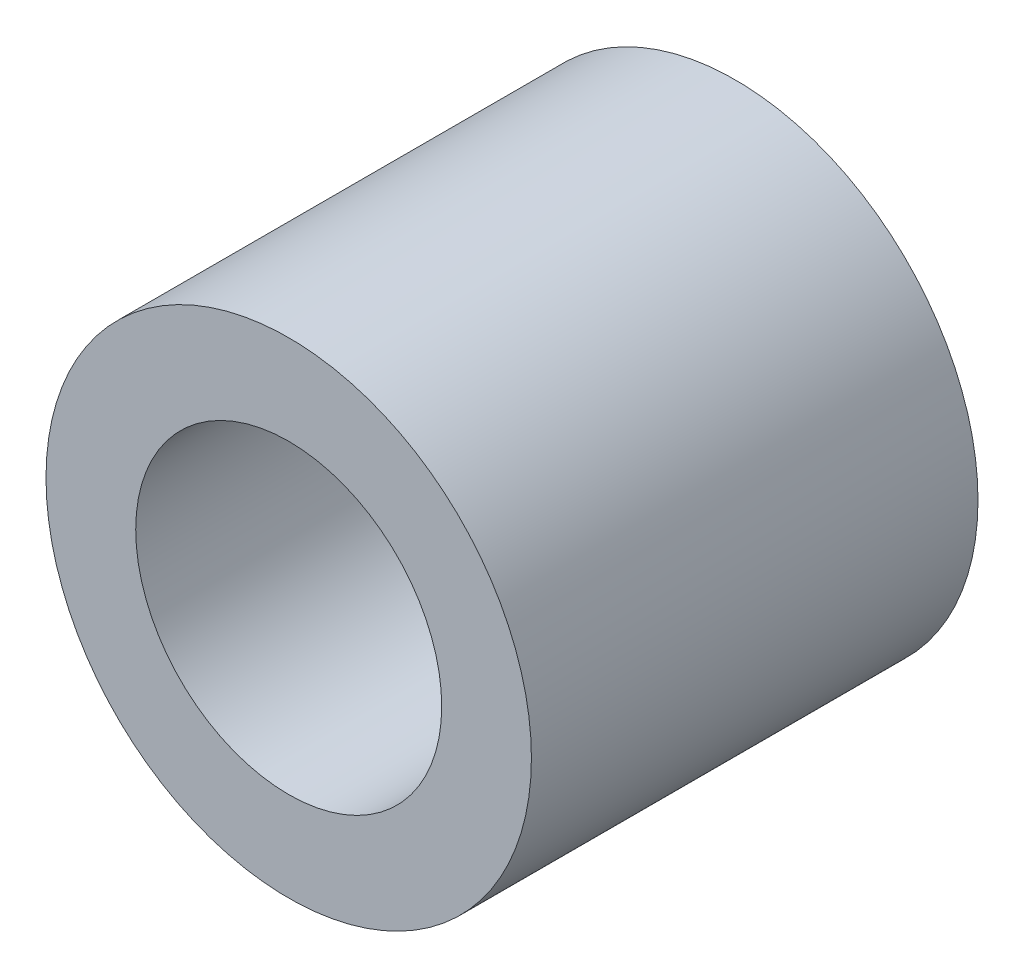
ISO-10303-21;
HEADER;
FILE_DESCRIPTION(('STEP AP214'),'2;1');
FILE_NAME('part.step','',(''),(''),'','','');
FILE_SCHEMA(('AUTOMOTIVE_DESIGN { 1 0 10303 214 1 1 1 1 }'));
ENDSEC;
DATA;
#1=APPLICATION_CONTEXT('core data for automotive mechanical design processes');
#2=APPLICATION_PROTOCOL_DEFINITION('international standard','automotive_design',2000,#1);
#3=PRODUCT_CONTEXT('',#1,'mechanical');
#4=PRODUCT('Part','Part','',(#3));
#5=PRODUCT_RELATED_PRODUCT_CATEGORY('part','',(#4));
#6=PRODUCT_DEFINITION_FORMATION('','',#4);
#7=PRODUCT_DEFINITION_CONTEXT('part definition',#1,'design');
#8=PRODUCT_DEFINITION('design','',#6,#7);
#9=PRODUCT_DEFINITION_SHAPE('','',#8);
#10=(LENGTH_UNIT() NAMED_UNIT(*) SI_UNIT(.MILLI.,.METRE.));
#11=(NAMED_UNIT(*) PLANE_ANGLE_UNIT() SI_UNIT($,.RADIAN.));
#12=(NAMED_UNIT(*) SI_UNIT($,.STERADIAN.) SOLID_ANGLE_UNIT());
#13=UNCERTAINTY_MEASURE_WITH_UNIT(LENGTH_MEASURE(1.E-05),#10,'distance_accuracy_value','');
#14=(GEOMETRIC_REPRESENTATION_CONTEXT(3) GLOBAL_UNCERTAINTY_ASSIGNED_CONTEXT((#13)) GLOBAL_UNIT_ASSIGNED_CONTEXT((#10,
#11,#12)) REPRESENTATION_CONTEXT('',''));
#15=CARTESIAN_POINT('',(0.,0.,0.));
#16=DIRECTION('',(0.,0.,1.));
#17=DIRECTION('',(1.,0.,0.));
#18=AXIS2_PLACEMENT_3D('',#15,#16,#17);
#19=CARTESIAN_POINT('',(0.,0.,14.605));
#20=DIRECTION('',(0.,0.,1.));
#21=DIRECTION('',(1.,0.,0.));
#22=AXIS2_PLACEMENT_3D('',#19,#20,#21);
#23=PLANE('',#22);
#24=CARTESIAN_POINT('',(0.,0.,14.605));
#25=DIRECTION('',(0.,0.,1.));
#26=DIRECTION('',(1.,0.,0.));
#27=AXIS2_PLACEMENT_3D('',#24,#25,#26);
#28=CIRCLE('',#27,7.9375);
#29=CARTESIAN_POINT('',(-7.9375,0.,14.605));
#30=VERTEX_POINT('',#29);
#31=EDGE_CURVE('E10',#30,#30,#28,.T.);
#32=ORIENTED_EDGE('',*,*,#31,.T.);
#33=EDGE_LOOP('',(#32));
#34=FACE_BOUND('',#33,.T.);
#35=CARTESIAN_POINT('',(0.,0.,14.605));
#36=DIRECTION('',(0.,0.,1.));
#37=DIRECTION('',(1.,0.,0.));
#38=AXIS2_PLACEMENT_3D('',#35,#36,#37);
#39=CIRCLE('',#38,5.0038);
#40=CARTESIAN_POINT('',(-5.0038,0.,14.605));
#41=VERTEX_POINT('',#40);
#42=EDGE_CURVE('E42',#41,#41,#39,.T.);
#43=ORIENTED_EDGE('',*,*,#42,.F.);
#44=EDGE_LOOP('',(#43));
#45=FACE_BOUND('',#44,.T.);
#46=ADVANCED_FACE('F31',(#34,#45),#23,.T.);
#47=CARTESIAN_POINT('',(0.,0.,0.));
#48=DIRECTION('',(0.,0.,1.));
#49=DIRECTION('',(1.,0.,0.));
#50=AXIS2_PLACEMENT_3D('',#47,#48,#49);
#51=PLANE('',#50);
#52=CARTESIAN_POINT('',(0.,0.,0.));
#53=DIRECTION('',(0.,0.,1.));
#54=DIRECTION('',(1.,0.,0.));
#55=AXIS2_PLACEMENT_3D('',#52,#53,#54);
#56=CIRCLE('',#55,7.9375);
#57=CARTESIAN_POINT('',(-7.9375,0.,0.));
#58=VERTEX_POINT('',#57);
#59=EDGE_CURVE('E35',#58,#58,#56,.T.);
#60=ORIENTED_EDGE('',*,*,#59,.F.);
#61=EDGE_LOOP('',(#60));
#62=FACE_BOUND('',#61,.T.);
#63=CARTESIAN_POINT('',(0.,0.,0.));
#64=DIRECTION('',(0.,0.,1.));
#65=DIRECTION('',(1.,0.,0.));
#66=AXIS2_PLACEMENT_3D('',#63,#64,#65);
#67=CIRCLE('',#66,5.0038);
#68=CARTESIAN_POINT('',(-5.0038,0.,0.));
#69=VERTEX_POINT('',#68);
#70=EDGE_CURVE('E44',#69,#69,#67,.T.);
#71=ORIENTED_EDGE('',*,*,#70,.T.);
#72=EDGE_LOOP('',(#71));
#73=FACE_BOUND('',#72,.T.);
#74=ADVANCED_FACE('F54',(#62,#73),#51,.F.);
#75=CARTESIAN_POINT('',(0.,0.,14.605));
#76=DIRECTION('',(0.,0.,-1.));
#77=DIRECTION('',(-1.,0.,0.));
#78=AXIS2_PLACEMENT_3D('',#75,#76,#77);
#79=CYLINDRICAL_SURFACE('',#78,7.9375);
#80=CARTESIAN_POINT('',(-7.9375,0.,14.605));
#81=CARTESIAN_POINT('',(-7.9375,0.,14.4528645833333));
#82=CARTESIAN_POINT('',(-7.9375,0.,14.3007291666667));
#83=CARTESIAN_POINT('',(-7.9375,0.,13.9964583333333));
#84=CARTESIAN_POINT('',(-7.9375,0.,13.8443229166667));
#85=CARTESIAN_POINT('',(-7.9375,0.,13.5400520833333));
#86=CARTESIAN_POINT('',(-7.9375,0.,13.3879166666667));
#87=CARTESIAN_POINT('',(-7.9375,0.,13.0836458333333));
#88=CARTESIAN_POINT('',(-7.9375,0.,12.9315104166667));
#89=CARTESIAN_POINT('',(-7.9375,0.,12.6272395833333));
#90=CARTESIAN_POINT('',(-7.9375,0.,12.4751041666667));
#91=CARTESIAN_POINT('',(-7.9375,0.,12.1708333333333));
#92=CARTESIAN_POINT('',(-7.9375,0.,12.0186979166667));
#93=CARTESIAN_POINT('',(-7.9375,0.,11.7144270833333));
#94=CARTESIAN_POINT('',(-7.9375,0.,11.5622916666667));
#95=CARTESIAN_POINT('',(-7.9375,0.,11.2580208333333));
#96=CARTESIAN_POINT('',(-7.9375,0.,11.1058854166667));
#97=CARTESIAN_POINT('',(-7.9375,0.,10.8016145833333));
#98=CARTESIAN_POINT('',(-7.9375,0.,10.6494791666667));
#99=CARTESIAN_POINT('',(-7.9375,0.,10.3452083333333));
#100=CARTESIAN_POINT('',(-7.9375,0.,10.1930729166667));
#101=CARTESIAN_POINT('',(-7.9375,0.,9.88880208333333));
#102=CARTESIAN_POINT('',(-7.9375,0.,9.73666666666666));
#103=CARTESIAN_POINT('',(-7.9375,0.,9.43239583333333));
#104=CARTESIAN_POINT('',(-7.9375,0.,9.28026041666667));
#105=CARTESIAN_POINT('',(-7.9375,0.,8.97598958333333));
#106=CARTESIAN_POINT('',(-7.9375,0.,8.82385416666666));
#107=CARTESIAN_POINT('',(-7.9375,0.,8.51958333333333));
#108=CARTESIAN_POINT('',(-7.9375,0.,8.36744791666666));
#109=CARTESIAN_POINT('',(-7.9375,0.,8.06317708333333));
#110=CARTESIAN_POINT('',(-7.9375,0.,7.91104166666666));
#111=CARTESIAN_POINT('',(-7.9375,0.,7.60677083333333));
#112=CARTESIAN_POINT('',(-7.9375,0.,7.45463541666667));
#113=CARTESIAN_POINT('',(-7.9375,0.,7.15036458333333));
#114=CARTESIAN_POINT('',(-7.9375,0.,6.99822916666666));
#115=CARTESIAN_POINT('',(-7.9375,0.,6.69395833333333));
#116=CARTESIAN_POINT('',(-7.9375,0.,6.54182291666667));
#117=CARTESIAN_POINT('',(-7.9375,0.,6.23755208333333));
#118=CARTESIAN_POINT('',(-7.9375,0.,6.08541666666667));
#119=CARTESIAN_POINT('',(-7.9375,0.,5.78114583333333));
#120=CARTESIAN_POINT('',(-7.9375,0.,5.62901041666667));
#121=CARTESIAN_POINT('',(-7.9375,0.,5.32473958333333));
#122=CARTESIAN_POINT('',(-7.9375,0.,5.17260416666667));
#123=CARTESIAN_POINT('',(-7.9375,0.,4.86833333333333));
#124=CARTESIAN_POINT('',(-7.9375,0.,4.71619791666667));
#125=CARTESIAN_POINT('',(-7.9375,0.,4.41192708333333));
#126=CARTESIAN_POINT('',(-7.9375,0.,4.25979166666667));
#127=CARTESIAN_POINT('',(-7.9375,0.,3.95552083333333));
#128=CARTESIAN_POINT('',(-7.9375,0.,3.80338541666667));
#129=CARTESIAN_POINT('',(-7.9375,0.,3.49911458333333));
#130=CARTESIAN_POINT('',(-7.9375,0.,3.34697916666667));
#131=CARTESIAN_POINT('',(-7.9375,0.,3.04270833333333));
#132=CARTESIAN_POINT('',(-7.9375,0.,2.89057291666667));
#133=CARTESIAN_POINT('',(-7.9375,0.,2.58630208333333));
#134=CARTESIAN_POINT('',(-7.9375,0.,2.43416666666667));
#135=CARTESIAN_POINT('',(-7.9375,0.,2.12989583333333));
#136=CARTESIAN_POINT('',(-7.9375,0.,1.97776041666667));
#137=CARTESIAN_POINT('',(-7.9375,0.,1.67348958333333));
#138=CARTESIAN_POINT('',(-7.9375,0.,1.52135416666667));
#139=CARTESIAN_POINT('',(-7.9375,0.,1.21708333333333));
#140=CARTESIAN_POINT('',(-7.9375,0.,1.06494791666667));
#141=CARTESIAN_POINT('',(-7.9375,0.,0.760677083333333));
#142=CARTESIAN_POINT('',(-7.9375,0.,0.608541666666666));
#143=CARTESIAN_POINT('',(-7.9375,0.,0.304270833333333));
#144=CARTESIAN_POINT('',(-7.9375,0.,0.152135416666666));
#145=CARTESIAN_POINT('',(-7.9375,0.,0.));
#146=B_SPLINE_CURVE_WITH_KNOTS('',3,(#80,#81,#82,#83,#84,#85,#86,#87,#88,#89,#90,#91,#92,#93,
#94,#95,#96,#97,#98,#99,#100,#101,#102,#103,#104,#105,#106,#107,#108,#109,#110,#111,#112,#113,
#114,#115,#116,#117,#118,#119,#120,#121,#122,#123,#124,#125,#126,#127,#128,#129,#130,#131,#132,
#133,#134,#135,#136,#137,#138,#139,#140,#141,#142,#143,#144,#145),.UNSPECIFIED.,.F.,.F.,(4,2,2,
2,2,2,2,2,2,2,2,2,2,2,2,2,2,2,2,2,2,2,2,2,2,2,2,2,2,2,2,2,4),(0.,0.456406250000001,0.9128125,
1.36921875,1.825625,2.28203125,2.7384375,3.19484375,3.65125,4.10765625,4.5640625,5.02046875,
5.476875,5.93328125,6.3896875,6.84609375,7.3025,7.75890625,8.2153125,8.67171875,9.128125,
9.58453125,10.0409375,10.49734375,10.95375,11.41015625,11.8665625,12.32296875,12.779375,
13.23578125,13.6921875,14.14859375,14.605),.UNSPECIFIED.);
#147=EDGE_CURVE('BSEAM33',#30,#58,#146,.T.);
#148=ORIENTED_EDGE('',*,*,#31,.F.);
#149=ORIENTED_EDGE('',*,*,#59,.T.);
#150=ORIENTED_EDGE('',*,*,#147,.T.);
#151=ORIENTED_EDGE('',*,*,#147,.F.);
#152=EDGE_LOOP('',(#148,#150,#149,#151));
#153=FACE_BOUND('',#152,.T.);
#154=ADVANCED_FACE('F33',(#153),#79,.T.);
#155=CARTESIAN_POINT('',(0.,0.,14.605));
#156=DIRECTION('',(0.,0.,-1.));
#157=DIRECTION('',(-1.,0.,0.));
#158=AXIS2_PLACEMENT_3D('',#155,#156,#157);
#159=CYLINDRICAL_SURFACE('',#158,5.0038);
#160=CARTESIAN_POINT('',(-5.0038,0.,14.605));
#161=CARTESIAN_POINT('',(-5.0038,0.,14.4528645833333));
#162=CARTESIAN_POINT('',(-5.0038,0.,14.3007291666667));
#163=CARTESIAN_POINT('',(-5.0038,0.,13.9964583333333));
#164=CARTESIAN_POINT('',(-5.0038,0.,13.8443229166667));
#165=CARTESIAN_POINT('',(-5.0038,0.,13.5400520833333));
#166=CARTESIAN_POINT('',(-5.0038,0.,13.3879166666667));
#167=CARTESIAN_POINT('',(-5.0038,0.,13.0836458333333));
#168=CARTESIAN_POINT('',(-5.0038,0.,12.9315104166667));
#169=CARTESIAN_POINT('',(-5.0038,0.,12.6272395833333));
#170=CARTESIAN_POINT('',(-5.0038,0.,12.4751041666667));
#171=CARTESIAN_POINT('',(-5.0038,0.,12.1708333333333));
#172=CARTESIAN_POINT('',(-5.0038,0.,12.0186979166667));
#173=CARTESIAN_POINT('',(-5.0038,0.,11.7144270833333));
#174=CARTESIAN_POINT('',(-5.0038,0.,11.5622916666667));
#175=CARTESIAN_POINT('',(-5.0038,0.,11.2580208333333));
#176=CARTESIAN_POINT('',(-5.0038,0.,11.1058854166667));
#177=CARTESIAN_POINT('',(-5.0038,0.,10.8016145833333));
#178=CARTESIAN_POINT('',(-5.0038,0.,10.6494791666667));
#179=CARTESIAN_POINT('',(-5.0038,0.,10.3452083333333));
#180=CARTESIAN_POINT('',(-5.0038,0.,10.1930729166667));
#181=CARTESIAN_POINT('',(-5.0038,0.,9.88880208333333));
#182=CARTESIAN_POINT('',(-5.0038,0.,9.73666666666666));
#183=CARTESIAN_POINT('',(-5.0038,0.,9.43239583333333));
#184=CARTESIAN_POINT('',(-5.0038,0.,9.28026041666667));
#185=CARTESIAN_POINT('',(-5.0038,0.,8.97598958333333));
#186=CARTESIAN_POINT('',(-5.0038,0.,8.82385416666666));
#187=CARTESIAN_POINT('',(-5.0038,0.,8.51958333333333));
#188=CARTESIAN_POINT('',(-5.0038,0.,8.36744791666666));
#189=CARTESIAN_POINT('',(-5.0038,0.,8.06317708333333));
#190=CARTESIAN_POINT('',(-5.0038,0.,7.91104166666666));
#191=CARTESIAN_POINT('',(-5.0038,0.,7.60677083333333));
#192=CARTESIAN_POINT('',(-5.0038,0.,7.45463541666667));
#193=CARTESIAN_POINT('',(-5.0038,0.,7.15036458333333));
#194=CARTESIAN_POINT('',(-5.0038,0.,6.99822916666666));
#195=CARTESIAN_POINT('',(-5.0038,0.,6.69395833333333));
#196=CARTESIAN_POINT('',(-5.0038,0.,6.54182291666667));
#197=CARTESIAN_POINT('',(-5.0038,0.,6.23755208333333));
#198=CARTESIAN_POINT('',(-5.0038,0.,6.08541666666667));
#199=CARTESIAN_POINT('',(-5.0038,0.,5.78114583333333));
#200=CARTESIAN_POINT('',(-5.0038,0.,5.62901041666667));
#201=CARTESIAN_POINT('',(-5.0038,0.,5.32473958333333));
#202=CARTESIAN_POINT('',(-5.0038,0.,5.17260416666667));
#203=CARTESIAN_POINT('',(-5.0038,0.,4.86833333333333));
#204=CARTESIAN_POINT('',(-5.0038,0.,4.71619791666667));
#205=CARTESIAN_POINT('',(-5.0038,0.,4.41192708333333));
#206=CARTESIAN_POINT('',(-5.0038,0.,4.25979166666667));
#207=CARTESIAN_POINT('',(-5.0038,0.,3.95552083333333));
#208=CARTESIAN_POINT('',(-5.0038,0.,3.80338541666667));
#209=CARTESIAN_POINT('',(-5.0038,0.,3.49911458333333));
#210=CARTESIAN_POINT('',(-5.0038,0.,3.34697916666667));
#211=CARTESIAN_POINT('',(-5.0038,0.,3.04270833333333));
#212=CARTESIAN_POINT('',(-5.0038,0.,2.89057291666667));
#213=CARTESIAN_POINT('',(-5.0038,0.,2.58630208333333));
#214=CARTESIAN_POINT('',(-5.0038,0.,2.43416666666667));
#215=CARTESIAN_POINT('',(-5.0038,0.,2.12989583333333));
#216=CARTESIAN_POINT('',(-5.0038,0.,1.97776041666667));
#217=CARTESIAN_POINT('',(-5.0038,0.,1.67348958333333));
#218=CARTESIAN_POINT('',(-5.0038,0.,1.52135416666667));
#219=CARTESIAN_POINT('',(-5.0038,0.,1.21708333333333));
#220=CARTESIAN_POINT('',(-5.0038,0.,1.06494791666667));
#221=CARTESIAN_POINT('',(-5.0038,0.,0.760677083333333));
#222=CARTESIAN_POINT('',(-5.0038,0.,0.608541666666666));
#223=CARTESIAN_POINT('',(-5.0038,0.,0.304270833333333));
#224=CARTESIAN_POINT('',(-5.0038,0.,0.152135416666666));
#225=CARTESIAN_POINT('',(-5.0038,0.,0.));
#226=B_SPLINE_CURVE_WITH_KNOTS('',3,(#160,#161,#162,#163,#164,#165,#166,#167,#168,#169,#170,
#171,#172,#173,#174,#175,#176,#177,#178,#179,#180,#181,#182,#183,#184,#185,#186,#187,#188,#189,
#190,#191,#192,#193,#194,#195,#196,#197,#198,#199,#200,#201,#202,#203,#204,#205,#206,#207,#208,
#209,#210,#211,#212,#213,#214,#215,#216,#217,#218,#219,#220,#221,#222,#223,#224,#225),
.UNSPECIFIED.,.F.,.F.,(4,2,2,2,2,2,2,2,2,2,2,2,2,2,2,2,2,2,2,2,2,2,2,2,2,2,2,2,2,2,2,2,4),(0.,
0.456406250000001,0.9128125,1.36921875,1.825625,2.28203125,2.7384375,3.19484375,3.65125,
4.10765625,4.5640625,5.02046875,5.476875,5.93328125,6.3896875,6.84609375,7.3025,7.75890625,
8.2153125,8.67171875,9.128125,9.58453125,10.0409375,10.49734375,10.95375,11.41015625,11.8665625,
12.32296875,12.779375,13.23578125,13.6921875,14.14859375,14.605),.UNSPECIFIED.);
#227=EDGE_CURVE('BSEAM50',#41,#69,#226,.T.);
#228=ORIENTED_EDGE('',*,*,#42,.T.);
#229=ORIENTED_EDGE('',*,*,#70,.F.);
#230=ORIENTED_EDGE('',*,*,#227,.T.);
#231=ORIENTED_EDGE('',*,*,#227,.F.);
#232=EDGE_LOOP('',(#228,#230,#229,#231));
#233=FACE_BOUND('',#232,.T.);
#234=ADVANCED_FACE('F50',(#233),#159,.F.);
#235=CLOSED_SHELL('',(#46,#74,#154,#234));
#236=MANIFOLD_SOLID_BREP('B2',#235);
#237=ADVANCED_BREP_SHAPE_REPRESENTATION('',(#18,#236),#14);
#238=SHAPE_DEFINITION_REPRESENTATION(#9,#237);
ENDSEC;
END-ISO-10303-21;
